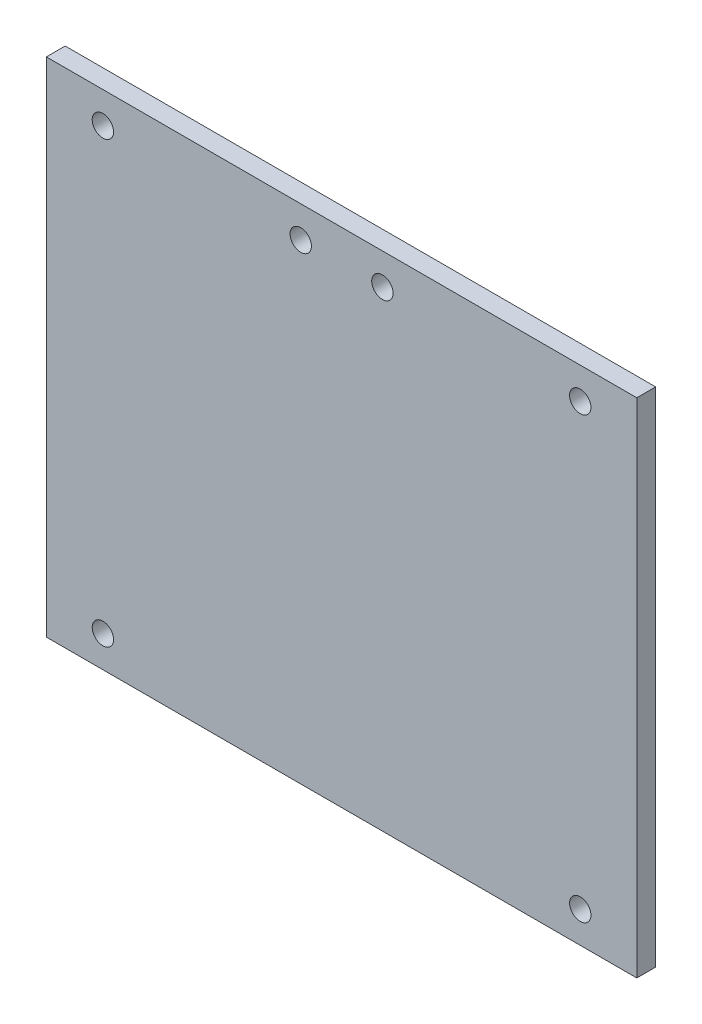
from build123d import *

# Parameters (mm, degrees)
SKETCH_1_W              = 94
SKETCH_1_H              = 80
EXTRUDE_1_DEPTH         = 3
HOLE_WIZARD_3_4_3_4_1_D = 3.4
HOLE_WIZARD_3_4_3_4_2_D = 3.4


with BuildPart() as part:
    # Sketch 1 → Extrude 1 (new body)
    with BuildSketch(Plane.XY):
        Rectangle(SKETCH_1_W, SKETCH_1_H)
    extrude(amount=EXTRUDE_1_DEPTH)

    # Hole Wizard 3.4 _3.4_ _1 (through all)
    with Locations(Plane.XY.offset(3)):
        with Locations((-6.5, 35), (6.5, 35)):
            Hole(HOLE_WIZARD_3_4_3_4_1_D / 2)

    # Hole Wizard 3.4 _3.4_ _2 (through all)
    with Locations(Plane.XY.offset(3)):
        with Locations((-38, 35), (38, 35), (-38, -35), (38, -35)):
            Hole(HOLE_WIZARD_3_4_3_4_2_D / 2)


solid = part.part
